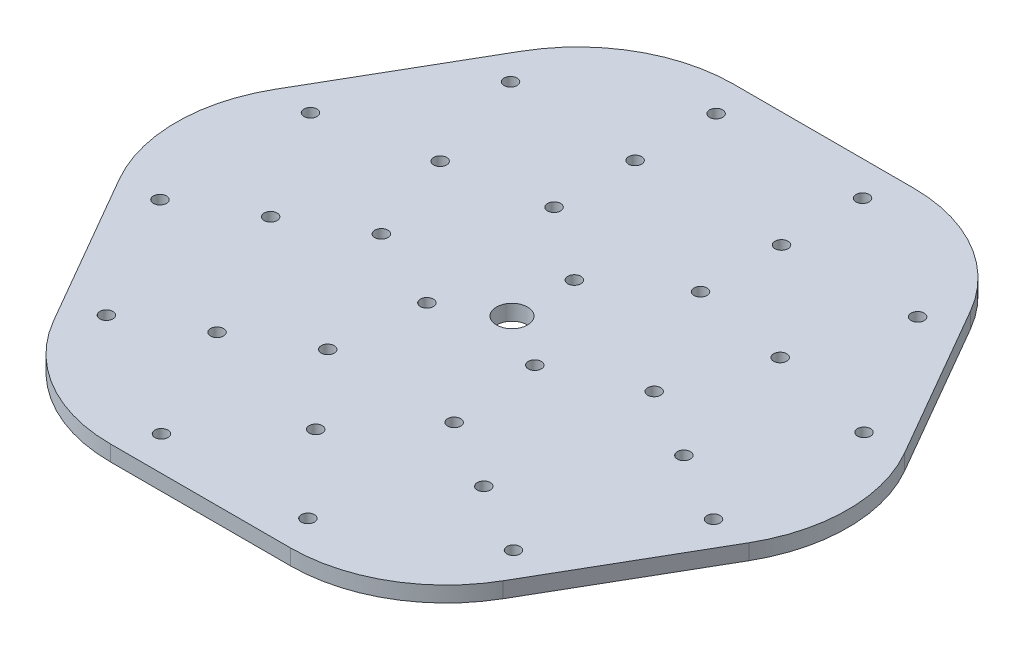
from build123d import *

# Parameters (mm, degrees)
EXTRUDE_1_DEPTH          = 5
SKETCH_2_R               = 2.1
CUT_EXTRUDE_1_DEPTH      = 153.834332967
PATTERN_CIRCULAR_1_COUNT = 3
SKETCH_3_R               = 2.1
CUT_EXTRUDE_2_DEPTH      = 153.834332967
PATTERN_CIRCULAR_2_COUNT = 3
SKETCH_4_R               = 2.1
CUT_EXTRUDE_3_DEPTH      = 153.834332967
PATTERN_CIRCULAR_3_COUNT = 3
FILLET_1_R               = 50
CUT_EXTRUDE_4_DEPTH      = 148.077653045
CUT_EXTRUDE_4_DEPTH_BACK = 148.077653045
SKETCH_5_R               = 5


with BuildPart() as part:
    # Sketch 1 → Extrude 1 (new body)
    with BuildSketch(Plane(origin=(0, 0, 0), x_dir=(1, 0, 0), z_dir=(0, 1, 0))):
        Polygon((57.735026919, 100), (-57.735026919, 100), (-115.470053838, 0), (-57.735026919, -100), (57.735026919, -100), (115.470053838, 0), align=None)
    extrude(amount=EXTRUDE_1_DEPTH)

    # Sketch 2 → Cut-Extrude 1 (cut, through all)
    with BuildSketch(Plane(origin=(0, 5, 0), x_dir=(1, 0, 0), z_dir=(0, 1, 0))):
        with Locations(Location((-23.5, 37, 0), (0, 0, 270))):
            Circle(SKETCH_2_R)
        with Locations(Location((23.5, 37, 0), (0, 0, 270))):
            Circle(SKETCH_2_R)
        with Locations(Location((-23.5, 63, 0), (0, 0, 270))):
            Circle(SKETCH_2_R)
        with Locations(Location((23.5, 63, 0), (0, 0, 270))):
            Circle(SKETCH_2_R)
        with Locations(Location((-23.5, 89, 0), (0, 0, 270))):
            Circle(SKETCH_2_R)
        with Locations(Location((23.5, 89, 0), (0, 0, 270))):
            Circle(SKETCH_2_R)
    cut_extrude_1 = extrude(amount=-CUT_EXTRUDE_1_DEPTH, mode=Mode.SUBTRACT)

    # Pattern Circular 1: Cut-Extrude 1 ×3 about axis
    pattern_circular_1_axis = Axis((0, 0, 0), (0, 1, 0))
    for i in range(1, PATTERN_CIRCULAR_1_COUNT):
        add(cut_extrude_1.rotate(pattern_circular_1_axis, i * 360 / PATTERN_CIRCULAR_1_COUNT), mode=Mode.SUBTRACT)

    # Sketch 3 → Cut-Extrude 2 (cut, through all)
    with BuildSketch(Plane(origin=(0, 5, 0), x_dir=(1, 0, 0), z_dir=(0, 1, 0))):
        with Locations(Location((65.326260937, 64.851596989, 0), (0, 0, 270))):
            Circle(SKETCH_3_R)
        with Locations(Location((88.826260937, 24.148403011, 0), (0, 0, 270))):
            Circle(SKETCH_3_R)
        with Locations(Location((54.559600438, 31.5, 0), (0, 0, 270))):
            Circle(SKETCH_3_R)
    cut_extrude_2 = extrude(amount=-CUT_EXTRUDE_2_DEPTH, mode=Mode.SUBTRACT)

    # Pattern Circular 2: Cut-Extrude 2 ×3 about axis
    pattern_circular_2_axis = Axis((0, 0, 0), (0, 1, 0))
    for i in range(1, PATTERN_CIRCULAR_2_COUNT):
        add(cut_extrude_2.rotate(pattern_circular_2_axis, i * 360 / PATTERN_CIRCULAR_2_COUNT), mode=Mode.SUBTRACT)

    # Sketch 4 → Cut-Extrude 3 (cut, through all)
    with BuildSketch(Plane(origin=(0, 5, 0), x_dir=(1, 0, 0), z_dir=(0, 1, 0))):
        with Locations(Location((0, 20, 0), (0, 0, 270))):
            Circle(SKETCH_4_R)
    cut_extrude_3 = extrude(amount=-CUT_EXTRUDE_3_DEPTH, mode=Mode.SUBTRACT)

    # Pattern Circular 3: Cut-Extrude 3 ×3 about axis
    pattern_circular_3_axis = Axis((0, 0, 0), (0, 1, 0))
    for i in range(1, PATTERN_CIRCULAR_3_COUNT):
        add(cut_extrude_3.rotate(pattern_circular_3_axis, i * 360 / PATTERN_CIRCULAR_3_COUNT), mode=Mode.SUBTRACT)

    # Fillet 1
    fillet_1_edges = [part.edges().sort_by_distance(p)[0] for p in [
        (115.470053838, 2.5, 0),
        (57.735026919, 2.5, 100),
        (-57.735026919, 2.5, 100),
        (-115.470053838, 2.5, 0),
        (-57.735026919, 2.5, -100),
        (57.735026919, 2.5, -100),
    ]]
    fillet(fillet_1_edges, radius=FILLET_1_R)

    # Sketch 5 → Cut-Extrude 4 (cut, two sides: drawn at the far end of the back side and taken through both)
    with BuildSketch(Plane(origin=(0, 5, 0), x_dir=(1, 0, 0), z_dir=(0, 1, 0)).offset(-CUT_EXTRUDE_4_DEPTH_BACK)):
        with Locations(Location((0, 0, 0), (0, 0, 270))):
            Circle(SKETCH_5_R)
    extrude(amount=CUT_EXTRUDE_4_DEPTH + CUT_EXTRUDE_4_DEPTH_BACK, mode=Mode.SUBTRACT)


solid = part.part
